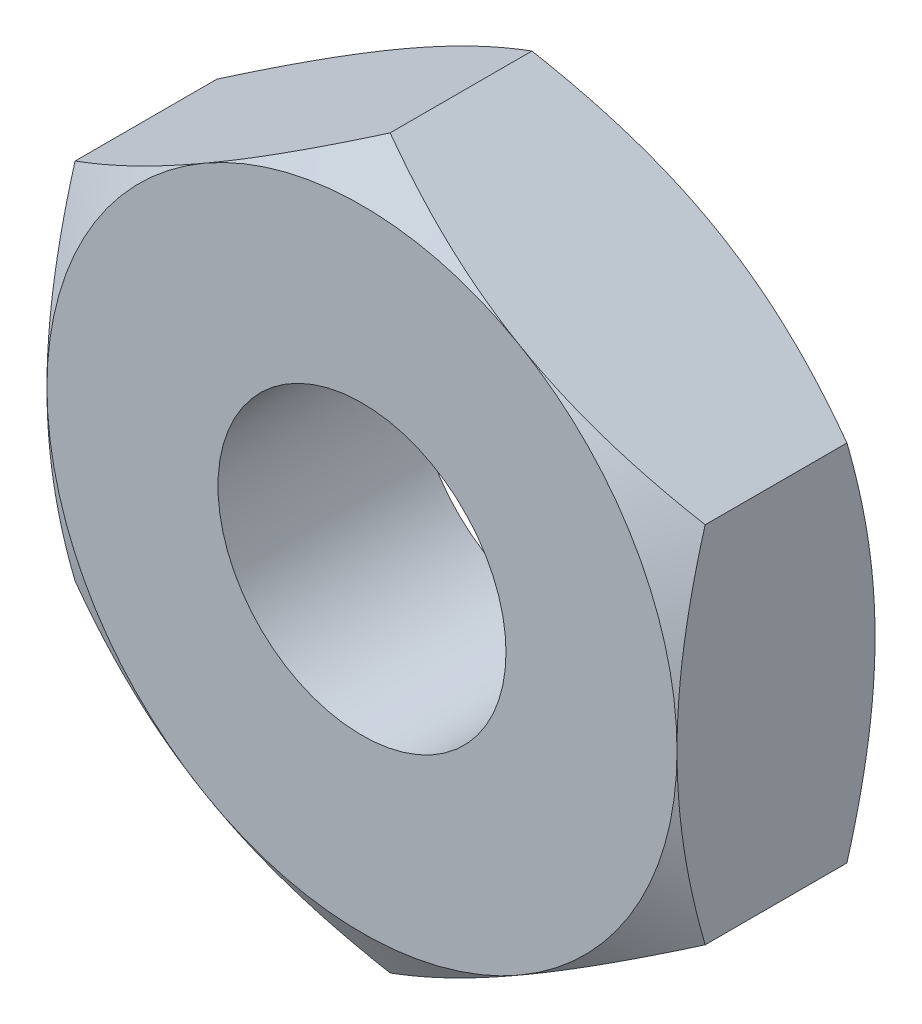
ISO-10303-21;
HEADER;
FILE_DESCRIPTION(('STEP AP214'),'2;1');
FILE_NAME('part.step','',(''),(''),'','','');
FILE_SCHEMA(('AUTOMOTIVE_DESIGN { 1 0 10303 214 1 1 1 1 }'));
ENDSEC;
DATA;
#1=APPLICATION_CONTEXT('core data for automotive mechanical design processes');
#2=APPLICATION_PROTOCOL_DEFINITION('international standard','automotive_design',2000,#1);
#3=PRODUCT_CONTEXT('',#1,'mechanical');
#4=PRODUCT('Part','Part','',(#3));
#5=PRODUCT_RELATED_PRODUCT_CATEGORY('part','',(#4));
#6=PRODUCT_DEFINITION_FORMATION('','',#4);
#7=PRODUCT_DEFINITION_CONTEXT('part definition',#1,'design');
#8=PRODUCT_DEFINITION('design','',#6,#7);
#9=PRODUCT_DEFINITION_SHAPE('','',#8);
#10=(LENGTH_UNIT() NAMED_UNIT(*) SI_UNIT(.MILLI.,.METRE.));
#11=(NAMED_UNIT(*) PLANE_ANGLE_UNIT() SI_UNIT($,.RADIAN.));
#12=(NAMED_UNIT(*) SI_UNIT($,.STERADIAN.) SOLID_ANGLE_UNIT());
#13=UNCERTAINTY_MEASURE_WITH_UNIT(LENGTH_MEASURE(1.E-05),#10,'distance_accuracy_value','');
#14=(GEOMETRIC_REPRESENTATION_CONTEXT(3) GLOBAL_UNCERTAINTY_ASSIGNED_CONTEXT((#13)) GLOBAL_UNIT_ASSIGNED_CONTEXT((#10,
#11,#12)) REPRESENTATION_CONTEXT('',''));
#15=CARTESIAN_POINT('',(0.,0.,0.));
#16=DIRECTION('',(0.,0.,1.));
#17=DIRECTION('',(1.,0.,0.));
#18=AXIS2_PLACEMENT_3D('',#15,#16,#17);
#19=CARTESIAN_POINT('',(-3.5,6.06217782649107,0.));
#20=DIRECTION('',(0.,0.,-1.));
#21=DIRECTION('',(-1.,0.,0.));
#22=AXIS2_PLACEMENT_3D('',#19,#20,#21);
#23=PLANE('',#22);
#24=CARTESIAN_POINT('',(0.,0.,0.));
#25=DIRECTION('',(0.,0.,1.));
#26=DIRECTION('',(1.,0.,0.));
#27=AXIS2_PLACEMENT_3D('',#24,#25,#26);
#28=CIRCLE('',#27,1.6);
#29=CARTESIAN_POINT('',(1.6,0.,0.));
#30=VERTEX_POINT('',#29);
#31=EDGE_CURVE('E316',#30,#30,#28,.T.);
#32=ORIENTED_EDGE('',*,*,#31,.F.);
#33=EDGE_LOOP('',(#32));
#34=FACE_BOUND('',#33,.T.);
#35=CARTESIAN_POINT('',(0.,0.,0.));
#36=DIRECTION('',(0.,0.,-1.));
#37=DIRECTION('',(-1.,0.,0.));
#38=AXIS2_PLACEMENT_3D('',#35,#36,#37);
#39=CIRCLE('',#38,3.5);
#40=CARTESIAN_POINT('',(-3.5,0.,0.));
#41=VERTEX_POINT('',#40);
#42=CARTESIAN_POINT('',(-1.75,3.03108891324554,0.));
#43=VERTEX_POINT('',#42);
#44=EDGE_CURVE('E324',#41,#43,#39,.T.);
#45=ORIENTED_EDGE('',*,*,#44,.F.);
#46=CARTESIAN_POINT('',(0.,0.,0.));
#47=DIRECTION('',(0.,0.,-1.));
#48=DIRECTION('',(-1.,0.,0.));
#49=AXIS2_PLACEMENT_3D('',#46,#47,#48);
#50=CIRCLE('',#49,3.5);
#51=CARTESIAN_POINT('',(-1.75,-3.03108891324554,0.));
#52=VERTEX_POINT('',#51);
#53=EDGE_CURVE('E146',#41,#52,#50,.F.);
#54=ORIENTED_EDGE('',*,*,#53,.T.);
#55=CARTESIAN_POINT('',(1.75,-3.03108891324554,0.));
#56=VERTEX_POINT('',#55);
#57=EDGE_CURVE('E248',#52,#56,#50,.F.);
#58=ORIENTED_EDGE('',*,*,#57,.T.);
#59=CARTESIAN_POINT('',(3.5,0.,0.));
#60=VERTEX_POINT('',#59);
#61=EDGE_CURVE('E149',#56,#60,#50,.F.);
#62=ORIENTED_EDGE('',*,*,#61,.T.);
#63=CARTESIAN_POINT('',(1.75,3.03108891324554,0.));
#64=VERTEX_POINT('',#63);
#65=EDGE_CURVE('E124',#60,#64,#50,.F.);
#66=ORIENTED_EDGE('',*,*,#65,.T.);
#67=EDGE_CURVE('E137',#64,#43,#50,.F.);
#68=ORIENTED_EDGE('',*,*,#67,.T.);
#69=EDGE_LOOP('',(#45,#54,#58,#62,#66,#68));
#70=FACE_BOUND('',#69,.T.);
#71=ADVANCED_FACE('F29',(#34,#70),#23,.F.);
#72=CARTESIAN_POINT('',(0.,0.,0.));
#73=DIRECTION('',(0.,0.,-1.));
#74=DIRECTION('',(-1.,0.,0.));
#75=AXIS2_PLACEMENT_3D('',#72,#73,#74);
#76=CONICAL_SURFACE('',#75,3.5,1.0471975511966);
#77=CARTESIAN_POINT('',(-3.5,-5.46924830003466,-1.72817064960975));
#78=CARTESIAN_POINT('',(-3.5,-5.3160325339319,-1.65368203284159));
#79=CARTESIAN_POINT('',(-3.5,-5.16246946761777,-1.57989576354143));
#80=CARTESIAN_POINT('',(-3.5,-4.85446420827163,-1.43412210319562));
#81=CARTESIAN_POINT('',(-3.5,-4.70002188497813,-1.36213498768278));
#82=CARTESIAN_POINT('',(-3.5,-4.38929746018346,-1.22000042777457));
#83=CARTESIAN_POINT('',(-3.5,-4.23300994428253,-1.14986477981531));
#84=CARTESIAN_POINT('',(-3.5,-3.91920628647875,-1.01240881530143));
#85=CARTESIAN_POINT('',(-3.5,-3.76169020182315,-0.945088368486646));
#86=CARTESIAN_POINT('',(-3.5,-3.43992986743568,-0.811830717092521));
#87=CARTESIAN_POINT('',(-3.5,-3.27563570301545,-0.746013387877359));
#88=CARTESIAN_POINT('',(-3.5,-2.94514050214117,-0.619260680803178));
#89=CARTESIAN_POINT('',(-3.5,-2.7789392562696,-0.558325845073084));
#90=CARTESIAN_POINT('',(-3.5,-2.44466350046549,-0.442907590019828));
#91=CARTESIAN_POINT('',(-3.5,-2.2765934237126,-0.388411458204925));
#92=CARTESIAN_POINT('',(-3.5,-1.93804244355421,-0.287592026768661));
#93=CARTESIAN_POINT('',(-3.5,-1.76756230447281,-0.241266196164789));
#94=CARTESIAN_POINT('',(-3.5,-1.42505372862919,-0.159233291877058));
#95=CARTESIAN_POINT('',(-3.5,-1.25303977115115,-0.123466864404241));
#96=CARTESIAN_POINT('',(-3.5,-0.906829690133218,-0.0645428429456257));
#97=CARTESIAN_POINT('',(-3.5,-0.732633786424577,-0.0413839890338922));
#98=CARTESIAN_POINT('',(-3.5,-0.385221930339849,-0.00982402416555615));
#99=CARTESIAN_POINT('',(-3.5,-0.212023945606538,-0.00123000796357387));
#100=CARTESIAN_POINT('',(-3.5,0.134483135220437,0.000982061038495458));
#101=CARTESIAN_POINT('',(-3.5,0.307792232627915,-0.00540006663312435));
#102=CARTESIAN_POINT('',(-3.5,0.600808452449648,-0.0283953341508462));
#103=CARTESIAN_POINT('',(-3.5,0.720823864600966,-0.0413165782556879));
#104=CARTESIAN_POINT('',(-3.5,0.959997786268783,-0.0735584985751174));
#105=CARTESIAN_POINT('',(-3.5,1.07915618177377,-0.092880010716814));
#106=CARTESIAN_POINT('',(-3.5,1.43517556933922,-0.159431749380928));
#107=CARTESIAN_POINT('',(-3.5,1.67045252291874,-0.215237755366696));
#108=CARTESIAN_POINT('',(-3.5,2.02230281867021,-0.312280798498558));
#109=CARTESIAN_POINT('',(-3.5,2.14069288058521,-0.34730856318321));
#110=CARTESIAN_POINT('',(-3.5,2.37632363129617,-0.421071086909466));
#111=CARTESIAN_POINT('',(-3.5,2.493564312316,-0.459805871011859));
#112=CARTESIAN_POINT('',(-3.5,2.72693202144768,-0.540355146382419));
#113=CARTESIAN_POINT('',(-3.5,2.84305938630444,-0.582168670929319));
#114=CARTESIAN_POINT('',(-3.5,3.07434746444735,-0.668376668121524));
#115=CARTESIAN_POINT('',(-3.5,3.18950819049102,-0.712771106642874));
#116=CARTESIAN_POINT('',(-3.5,3.46665383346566,-0.822612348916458));
#117=CARTESIAN_POINT('',(-3.5,3.62820926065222,-0.889140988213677));
#118=CARTESIAN_POINT('',(-3.5,3.94989428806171,-1.0255706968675));
#119=CARTESIAN_POINT('',(-3.5,4.11002378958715,-1.09547199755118));
#120=CARTESIAN_POINT('',(-3.5,4.42912766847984,-1.23795147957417));
#121=CARTESIAN_POINT('',(-3.5,4.58810177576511,-1.31053026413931));
#122=CARTESIAN_POINT('',(-3.5,4.9050615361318,-1.45781837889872));
#123=CARTESIAN_POINT('',(-3.5,5.06304716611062,-1.5325277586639));
#124=CARTESIAN_POINT('',(-3.5,5.53614087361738,-1.75938858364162));
#125=CARTESIAN_POINT('',(-3.5,5.85001764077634,-1.91410589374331));
#126=CARTESIAN_POINT('',(-3.5,6.47541755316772,-2.22809162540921));
#127=CARTESIAN_POINT('',(-3.5,6.78694100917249,-2.38735943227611));
#128=CARTESIAN_POINT('',(-3.5,7.38120615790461,-2.6950811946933));
#129=CARTESIAN_POINT('',(-3.5,7.66408741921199,-2.84326612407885));
#130=CARTESIAN_POINT('',(-3.5,8.22880069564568,-3.14164545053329));
#131=CARTESIAN_POINT('',(-3.5,8.5106326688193,-3.29183992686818));
#132=CARTESIAN_POINT('',(-3.5,9.07272628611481,-3.59335012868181));
#133=CARTESIAN_POINT('',(-3.5,9.35299011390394,-3.74466178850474));
#134=CARTESIAN_POINT('',(-3.5,9.91284986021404,-4.04847672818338));
#135=CARTESIAN_POINT('',(-3.5,10.1924458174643,-4.20097993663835));
#136=CARTESIAN_POINT('',(-3.5,10.4717977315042,-4.35392562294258));
#137=B_SPLINE_CURVE_WITH_KNOTS('',3,(#77,#78,#79,#80,#81,#82,#83,#84,#85,#86,#87,#88,#89,#90,
#91,#92,#93,#94,#95,#96,#97,#98,#99,#100,#101,#102,#103,#104,#105,#106,#107,#108,#109,#110,#111,
#112,#113,#114,#115,#116,#117,#118,#119,#120,#121,#122,#123,#124,#125,#126,#127,#128,#129,#130,
#131,#132,#133,#134,#135,#136),.UNSPECIFIED.,.F.,.F.,(4,2,2,2,2,2,2,2,2,2,2,2,2,2,2,2,2,2,2,2,2,
2,2,2,2,2,2,2,2,4),(0.,0.511095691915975,1.02226918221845,1.53615661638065,2.05002024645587,
2.58092205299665,3.11188272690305,3.64177691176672,4.17150665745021,4.69819951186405,
5.22483972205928,5.74444865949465,6.26406385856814,6.62601594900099,6.98801533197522,
7.71239857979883,8.08275565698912,8.45311523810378,8.82335901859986,9.193597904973,
9.71769804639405,10.2418341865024,10.7660891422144,11.2903563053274,12.3401028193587,
13.3897081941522,14.3477294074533,15.3057885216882,16.2612890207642,17.216732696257),.UNSPECIFIED.);
#138=CARTESIAN_POINT('',(-3.5,2.0207259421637,-0.312607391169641));
#139=VERTEX_POINT('',#138);
#140=EDGE_CURVE('E154',#139,#41,#137,.F.);
#141=ORIENTED_EDGE('',*,*,#140,.T.);
#142=ORIENTED_EDGE('',*,*,#44,.T.);
#143=CARTESIAN_POINT('',(0.0002,4.04156735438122,-0.312674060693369));
#144=CARTESIAN_POINT('',(-0.153607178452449,3.9527667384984,-0.261385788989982));
#145=CARTESIAN_POINT('',(-0.308742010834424,3.86319960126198,-0.214740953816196));
#146=CARTESIAN_POINT('',(-0.621698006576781,3.68251437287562,-0.133321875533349));
#147=CARTESIAN_POINT('',(-0.779524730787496,3.59139307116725,-0.0985764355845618));
#148=CARTESIAN_POINT('',(-1.09322221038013,3.41027974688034,-0.0444900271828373));
#149=CARTESIAN_POINT('',(-1.24904469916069,3.32031559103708,-0.0247890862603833));
#150=CARTESIAN_POINT('',(-1.56142288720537,3.13996396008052,-0.00127013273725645));
#151=CARTESIAN_POINT('',(-1.71797745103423,3.04957714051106,0.00256735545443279));
#152=CARTESIAN_POINT('',(-2.01050921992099,2.88068384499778,-0.00541530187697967));
#153=CARTESIAN_POINT('',(-2.14653021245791,2.80215208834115,-0.0152754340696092));
#154=CARTESIAN_POINT('',(-2.41768602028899,2.64560020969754,-0.0465264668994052));
#155=CARTESIAN_POINT('',(-2.55281989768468,2.5675806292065,-0.0679280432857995));
#156=CARTESIAN_POINT('',(-2.82453479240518,2.41070596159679,-0.121430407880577));
#157=CARTESIAN_POINT('',(-2.96108141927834,2.33187072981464,-0.153757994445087));
#158=CARTESIAN_POINT('',(-3.2321380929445,2.17537608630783,-0.227128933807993));
#159=CARTESIAN_POINT('',(-3.36665161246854,2.09771466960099,-0.268155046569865));
#160=CARTESIAN_POINT('',(-3.5002,2.02061047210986,-0.312674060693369));
#161=B_SPLINE_CURVE_WITH_KNOTS('',3,(#143,#144,#145,#146,#147,#148,#149,#150,#151,#152,#153,
#154,#155,#156,#157,#158,#159,#160),.UNSPECIFIED.,.F.,.F.,(4,2,2,2,2,2,2,2,4),(0.,
0.554793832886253,1.11092123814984,1.65328467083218,2.19498204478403,2.6666513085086,
3.13875761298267,3.62133612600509,4.10296698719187),.UNSPECIFIED.);
#162=EDGE_CURVE('E186',#43,#139,#161,.T.);
#163=ORIENTED_EDGE('',*,*,#162,.T.);
#164=EDGE_LOOP('',(#141,#142,#163));
#165=FACE_BOUND('',#164,.T.);
#166=ADVANCED_FACE('F173',(#165),#76,.T.);
#167=CARTESIAN_POINT('',(3.5002,2.02061047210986,-0.312674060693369));
#168=CARTESIAN_POINT('',(3.34639282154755,2.10941108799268,-0.261385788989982));
#169=CARTESIAN_POINT('',(3.19125798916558,2.1989782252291,-0.214740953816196));
#170=CARTESIAN_POINT('',(2.87830199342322,2.37966345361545,-0.133321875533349));
#171=CARTESIAN_POINT('',(2.7204752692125,2.47078475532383,-0.0985764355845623));
#172=CARTESIAN_POINT('',(2.40677778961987,2.65189807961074,-0.0444900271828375));
#173=CARTESIAN_POINT('',(2.25095530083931,2.741862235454,-0.0247890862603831));
#174=CARTESIAN_POINT('',(1.93857711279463,2.92221386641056,-0.0012701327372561));
#175=CARTESIAN_POINT('',(1.78202254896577,3.01260068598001,0.00256735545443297));
#176=CARTESIAN_POINT('',(1.48949078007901,3.1814939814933,-0.00541530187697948));
#177=CARTESIAN_POINT('',(1.35346978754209,3.26002573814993,-0.0152754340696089));
#178=CARTESIAN_POINT('',(1.08231397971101,3.41657761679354,-0.0465264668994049));
#179=CARTESIAN_POINT('',(0.947180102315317,3.49459719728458,-0.0679280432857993));
#180=CARTESIAN_POINT('',(0.675465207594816,3.65147186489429,-0.121430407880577));
#181=CARTESIAN_POINT('',(0.538918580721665,3.73030709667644,-0.153757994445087));
#182=CARTESIAN_POINT('',(0.267861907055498,3.88680174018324,-0.227128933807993));
#183=CARTESIAN_POINT('',(0.133348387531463,3.96446315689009,-0.268155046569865));
#184=CARTESIAN_POINT('',(-0.000199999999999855,4.04156735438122,-0.312674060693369));
#185=B_SPLINE_CURVE_WITH_KNOTS('',3,(#167,#168,#169,#170,#171,#172,#173,#174,#175,#176,#177,
#178,#179,#180,#181,#182,#183,#184),.UNSPECIFIED.,.F.,.F.,(4,2,2,2,2,2,2,2,4),(0.,
0.554793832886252,1.11092123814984,1.65328467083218,2.19498204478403,2.6666513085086,
3.13875761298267,3.62133612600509,4.10296698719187),.UNSPECIFIED.);
#186=CARTESIAN_POINT('',(0.,4.04145188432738,-0.312607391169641));
#187=VERTEX_POINT('',#186);
#188=EDGE_CURVE('E133',#64,#187,#185,.T.);
#189=ORIENTED_EDGE('',*,*,#188,.T.);
#190=EDGE_CURVE('E140',#187,#43,#161,.T.);
#191=ORIENTED_EDGE('',*,*,#190,.T.);
#192=ORIENTED_EDGE('',*,*,#67,.F.);
#193=EDGE_LOOP('',(#189,#191,#192));
#194=FACE_BOUND('',#193,.T.);
#195=ADVANCED_FACE('F138',(#194),#76,.T.);
#196=CARTESIAN_POINT('',(3.5,-5.46924830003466,-1.72817064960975));
#197=CARTESIAN_POINT('',(3.5,-5.3160325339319,-1.65368203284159));
#198=CARTESIAN_POINT('',(3.5,-5.16246946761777,-1.57989576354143));
#199=CARTESIAN_POINT('',(3.5,-4.85446420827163,-1.43412210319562));
#200=CARTESIAN_POINT('',(3.5,-4.70002188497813,-1.36213498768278));
#201=CARTESIAN_POINT('',(3.5,-4.38929746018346,-1.22000042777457));
#202=CARTESIAN_POINT('',(3.5,-4.23300994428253,-1.14986477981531));
#203=CARTESIAN_POINT('',(3.5,-3.91920628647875,-1.01240881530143));
#204=CARTESIAN_POINT('',(3.5,-3.76169020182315,-0.945088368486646));
#205=CARTESIAN_POINT('',(3.5,-3.43992986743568,-0.811830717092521));
#206=CARTESIAN_POINT('',(3.5,-3.27563570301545,-0.746013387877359));
#207=CARTESIAN_POINT('',(3.5,-2.94514050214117,-0.619260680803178));
#208=CARTESIAN_POINT('',(3.5,-2.7789392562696,-0.558325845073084));
#209=CARTESIAN_POINT('',(3.5,-2.44466350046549,-0.442907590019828));
#210=CARTESIAN_POINT('',(3.5,-2.2765934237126,-0.388411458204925));
#211=CARTESIAN_POINT('',(3.5,-1.93804244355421,-0.287592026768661));
#212=CARTESIAN_POINT('',(3.5,-1.76756230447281,-0.241266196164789));
#213=CARTESIAN_POINT('',(3.5,-1.42505372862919,-0.159233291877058));
#214=CARTESIAN_POINT('',(3.5,-1.25303977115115,-0.123466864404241));
#215=CARTESIAN_POINT('',(3.5,-0.906829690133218,-0.0645428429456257));
#216=CARTESIAN_POINT('',(3.5,-0.732633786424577,-0.0413839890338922));
#217=CARTESIAN_POINT('',(3.5,-0.385221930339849,-0.00982402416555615));
#218=CARTESIAN_POINT('',(3.5,-0.212023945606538,-0.00123000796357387));
#219=CARTESIAN_POINT('',(3.5,0.134483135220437,0.000982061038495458));
#220=CARTESIAN_POINT('',(3.5,0.307792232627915,-0.00540006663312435));
#221=CARTESIAN_POINT('',(3.5,0.600808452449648,-0.0283953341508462));
#222=CARTESIAN_POINT('',(3.5,0.720823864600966,-0.0413165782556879));
#223=CARTESIAN_POINT('',(3.5,0.959997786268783,-0.0735584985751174));
#224=CARTESIAN_POINT('',(3.5,1.07915618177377,-0.092880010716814));
#225=CARTESIAN_POINT('',(3.5,1.43517556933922,-0.159431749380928));
#226=CARTESIAN_POINT('',(3.5,1.67045252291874,-0.215237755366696));
#227=CARTESIAN_POINT('',(3.5,2.02230281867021,-0.312280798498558));
#228=CARTESIAN_POINT('',(3.5,2.14069288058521,-0.34730856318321));
#229=CARTESIAN_POINT('',(3.5,2.37632363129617,-0.421071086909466));
#230=CARTESIAN_POINT('',(3.5,2.493564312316,-0.459805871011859));
#231=CARTESIAN_POINT('',(3.5,2.72693202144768,-0.540355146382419));
#232=CARTESIAN_POINT('',(3.5,2.84305938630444,-0.582168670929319));
#233=CARTESIAN_POINT('',(3.5,3.07434746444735,-0.668376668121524));
#234=CARTESIAN_POINT('',(3.5,3.18950819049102,-0.712771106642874));
#235=CARTESIAN_POINT('',(3.5,3.46665383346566,-0.822612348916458));
#236=CARTESIAN_POINT('',(3.5,3.62820926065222,-0.889140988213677));
#237=CARTESIAN_POINT('',(3.5,3.94989428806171,-1.0255706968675));
#238=CARTESIAN_POINT('',(3.5,4.11002378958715,-1.09547199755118));
#239=CARTESIAN_POINT('',(3.5,4.42912766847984,-1.23795147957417));
#240=CARTESIAN_POINT('',(3.5,4.58810177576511,-1.31053026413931));
#241=CARTESIAN_POINT('',(3.5,4.9050615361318,-1.45781837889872));
#242=CARTESIAN_POINT('',(3.5,5.06304716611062,-1.5325277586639));
#243=CARTESIAN_POINT('',(3.5,5.53614087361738,-1.75938858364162));
#244=CARTESIAN_POINT('',(3.5,5.85001764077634,-1.91410589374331));
#245=CARTESIAN_POINT('',(3.5,6.47541755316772,-2.22809162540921));
#246=CARTESIAN_POINT('',(3.5,6.78694100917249,-2.38735943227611));
#247=CARTESIAN_POINT('',(3.5,7.38120615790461,-2.6950811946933));
#248=CARTESIAN_POINT('',(3.5,7.66408741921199,-2.84326612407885));
#249=CARTESIAN_POINT('',(3.5,8.22880069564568,-3.14164545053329));
#250=CARTESIAN_POINT('',(3.5,8.5106326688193,-3.29183992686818));
#251=CARTESIAN_POINT('',(3.5,9.07272628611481,-3.59335012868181));
#252=CARTESIAN_POINT('',(3.5,9.35299011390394,-3.74466178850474));
#253=CARTESIAN_POINT('',(3.5,9.91284986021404,-4.04847672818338));
#254=CARTESIAN_POINT('',(3.5,10.1924458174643,-4.20097993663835));
#255=CARTESIAN_POINT('',(3.5,10.4717977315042,-4.35392562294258));
#256=B_SPLINE_CURVE_WITH_KNOTS('',3,(#196,#197,#198,#199,#200,#201,#202,#203,#204,#205,#206,
#207,#208,#209,#210,#211,#212,#213,#214,#215,#216,#217,#218,#219,#220,#221,#222,#223,#224,#225,
#226,#227,#228,#229,#230,#231,#232,#233,#234,#235,#236,#237,#238,#239,#240,#241,#242,#243,#244,
#245,#246,#247,#248,#249,#250,#251,#252,#253,#254,#255),.UNSPECIFIED.,.F.,.F.,(4,2,2,2,2,2,2,2,
2,2,2,2,2,2,2,2,2,2,2,2,2,2,2,2,2,2,2,2,2,4),(0.,0.511095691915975,1.02226918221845,
1.53615661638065,2.05002024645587,2.58092205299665,3.11188272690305,3.64177691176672,
4.17150665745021,4.69819951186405,5.22483972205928,5.74444865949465,6.26406385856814,
6.62601594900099,6.98801533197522,7.71239857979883,8.08275565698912,8.45311523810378,
8.82335901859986,9.193597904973,9.71769804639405,10.2418341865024,10.7660891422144,
11.2903563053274,12.3401028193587,13.3897081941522,14.3477294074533,15.3057885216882,
16.2612890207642,17.216732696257),.UNSPECIFIED.);
#257=CARTESIAN_POINT('',(3.5,2.0207259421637,-0.312607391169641));
#258=VERTEX_POINT('',#257);
#259=EDGE_CURVE('E127',#60,#258,#256,.T.);
#260=ORIENTED_EDGE('',*,*,#259,.T.);
#261=EDGE_CURVE('E120',#258,#64,#185,.T.);
#262=ORIENTED_EDGE('',*,*,#261,.T.);
#263=ORIENTED_EDGE('',*,*,#65,.F.);
#264=EDGE_LOOP('',(#260,#262,#263));
#265=FACE_BOUND('',#264,.T.);
#266=ADVANCED_FACE('F122',(#265),#76,.T.);
#267=CARTESIAN_POINT('',(-0.0002,-4.04156735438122,-0.312674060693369));
#268=CARTESIAN_POINT('',(0.153607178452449,-3.9527667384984,-0.261385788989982));
#269=CARTESIAN_POINT('',(0.308742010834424,-3.86319960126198,-0.214740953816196));
#270=CARTESIAN_POINT('',(0.621698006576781,-3.68251437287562,-0.133321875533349));
#271=CARTESIAN_POINT('',(0.779524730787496,-3.59139307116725,-0.0985764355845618));
#272=CARTESIAN_POINT('',(1.09322221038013,-3.41027974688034,-0.0444900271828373));
#273=CARTESIAN_POINT('',(1.24904469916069,-3.32031559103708,-0.0247890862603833));
#274=CARTESIAN_POINT('',(1.56142288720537,-3.13996396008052,-0.00127013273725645));
#275=CARTESIAN_POINT('',(1.71797745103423,-3.04957714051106,0.00256735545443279));
#276=CARTESIAN_POINT('',(2.01050921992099,-2.88068384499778,-0.00541530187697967));
#277=CARTESIAN_POINT('',(2.14653021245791,-2.80215208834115,-0.0152754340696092));
#278=CARTESIAN_POINT('',(2.41768602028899,-2.64560020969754,-0.0465264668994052));
#279=CARTESIAN_POINT('',(2.55281989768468,-2.5675806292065,-0.0679280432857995));
#280=CARTESIAN_POINT('',(2.82453479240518,-2.41070596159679,-0.121430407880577));
#281=CARTESIAN_POINT('',(2.96108141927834,-2.33187072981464,-0.153757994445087));
#282=CARTESIAN_POINT('',(3.2321380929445,-2.17537608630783,-0.227128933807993));
#283=CARTESIAN_POINT('',(3.36665161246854,-2.09771466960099,-0.268155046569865));
#284=CARTESIAN_POINT('',(3.5002,-2.02061047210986,-0.312674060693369));
#285=B_SPLINE_CURVE_WITH_KNOTS('',3,(#267,#268,#269,#270,#271,#272,#273,#274,#275,#276,#277,
#278,#279,#280,#281,#282,#283,#284),.UNSPECIFIED.,.F.,.F.,(4,2,2,2,2,2,2,2,4),(0.,
0.554793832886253,1.11092123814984,1.65328467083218,2.19498204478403,2.6666513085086,
3.13875761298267,3.62133612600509,4.10296698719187),.UNSPECIFIED.);
#286=CARTESIAN_POINT('',(3.5,-2.020725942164,-0.312607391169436));
#287=VERTEX_POINT('',#286);
#288=EDGE_CURVE('E200',#56,#287,#285,.T.);
#289=ORIENTED_EDGE('',*,*,#288,.T.);
#290=EDGE_CURVE('E199',#287,#60,#256,.T.);
#291=ORIENTED_EDGE('',*,*,#290,.T.);
#292=ORIENTED_EDGE('',*,*,#61,.F.);
#293=EDGE_LOOP('',(#289,#291,#292));
#294=FACE_BOUND('',#293,.T.);
#295=ADVANCED_FACE('F424',(#294),#76,.T.);
#296=CARTESIAN_POINT('',(0.,-4.04145188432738,-0.312607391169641));
#297=VERTEX_POINT('',#296);
#298=EDGE_CURVE('E258',#297,#56,#285,.T.);
#299=ORIENTED_EDGE('',*,*,#298,.T.);
#300=ORIENTED_EDGE('',*,*,#57,.F.);
#301=CARTESIAN_POINT('',(-3.5002,-2.02061047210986,-0.312674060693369));
#302=CARTESIAN_POINT('',(-3.34639282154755,-2.10941108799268,-0.261385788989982));
#303=CARTESIAN_POINT('',(-3.19125798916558,-2.1989782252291,-0.214740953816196));
#304=CARTESIAN_POINT('',(-2.87830199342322,-2.37966345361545,-0.133321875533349));
#305=CARTESIAN_POINT('',(-2.7204752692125,-2.47078475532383,-0.0985764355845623));
#306=CARTESIAN_POINT('',(-2.40677778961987,-2.65189807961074,-0.0444900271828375));
#307=CARTESIAN_POINT('',(-2.25095530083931,-2.741862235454,-0.0247890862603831));
#308=CARTESIAN_POINT('',(-1.93857711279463,-2.92221386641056,-0.0012701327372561));
#309=CARTESIAN_POINT('',(-1.78202254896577,-3.01260068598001,0.00256735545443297));
#310=CARTESIAN_POINT('',(-1.48949078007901,-3.1814939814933,-0.00541530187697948));
#311=CARTESIAN_POINT('',(-1.35346978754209,-3.26002573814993,-0.0152754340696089));
#312=CARTESIAN_POINT('',(-1.08231397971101,-3.41657761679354,-0.0465264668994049));
#313=CARTESIAN_POINT('',(-0.947180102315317,-3.49459719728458,-0.0679280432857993));
#314=CARTESIAN_POINT('',(-0.675465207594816,-3.65147186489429,-0.121430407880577));
#315=CARTESIAN_POINT('',(-0.538918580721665,-3.73030709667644,-0.153757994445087));
#316=CARTESIAN_POINT('',(-0.267861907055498,-3.88680174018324,-0.227128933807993));
#317=CARTESIAN_POINT('',(-0.133348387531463,-3.96446315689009,-0.268155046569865));
#318=CARTESIAN_POINT('',(0.000199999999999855,-4.04156735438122,-0.312674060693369));
#319=B_SPLINE_CURVE_WITH_KNOTS('',3,(#301,#302,#303,#304,#305,#306,#307,#308,#309,#310,#311,
#312,#313,#314,#315,#316,#317,#318),.UNSPECIFIED.,.F.,.F.,(4,2,2,2,2,2,2,2,4),(0.,
0.554793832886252,1.11092123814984,1.65328467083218,2.19498204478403,2.6666513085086,
3.13875761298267,3.62133612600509,4.10296698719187),.UNSPECIFIED.);
#320=EDGE_CURVE('E262',#52,#297,#319,.T.);
#321=ORIENTED_EDGE('',*,*,#320,.T.);
#322=EDGE_LOOP('',(#299,#300,#321));
#323=FACE_BOUND('',#322,.T.);
#324=ADVANCED_FACE('F179',(#323),#76,.T.);
#325=CARTESIAN_POINT('',(-3.5,-2.020725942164,-0.312607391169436));
#326=VERTEX_POINT('',#325);
#327=EDGE_CURVE('E167',#326,#52,#319,.T.);
#328=ORIENTED_EDGE('',*,*,#327,.T.);
#329=ORIENTED_EDGE('',*,*,#53,.F.);
#330=EDGE_CURVE('E132',#41,#326,#137,.F.);
#331=ORIENTED_EDGE('',*,*,#330,.T.);
#332=EDGE_LOOP('',(#328,#329,#331));
#333=FACE_BOUND('',#332,.T.);
#334=ADVANCED_FACE('F267',(#333),#76,.T.);
#335=CARTESIAN_POINT('',(3.5,2.0207259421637,-2.2));
#336=DIRECTION('',(0.499999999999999,0.866025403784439,0.));
#337=DIRECTION('',(-0.866025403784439,0.499999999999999,0.));
#338=AXIS2_PLACEMENT_3D('',#335,#336,#337);
#339=PLANE('',#338);
#340=CARTESIAN_POINT('',(-0.0002,4.04156735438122,-1.88732593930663));
#341=CARTESIAN_POINT('',(0.153607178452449,3.9527667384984,-1.93861421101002));
#342=CARTESIAN_POINT('',(0.308742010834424,3.86319960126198,-1.9852590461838));
#343=CARTESIAN_POINT('',(0.621698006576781,3.68251437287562,-2.06667812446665));
#344=CARTESIAN_POINT('',(0.779524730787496,3.59139307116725,-2.10142356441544));
#345=CARTESIAN_POINT('',(1.09322221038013,3.41027974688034,-2.15550997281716));
#346=CARTESIAN_POINT('',(1.24904469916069,3.32031559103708,-2.17521091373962));
#347=CARTESIAN_POINT('',(1.56142288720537,3.13996396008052,-2.19872986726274));
#348=CARTESIAN_POINT('',(1.71797745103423,3.04957714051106,-2.20256735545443));
#349=CARTESIAN_POINT('',(2.01050921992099,2.88068384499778,-2.19458469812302));
#350=CARTESIAN_POINT('',(2.14653021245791,2.80215208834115,-2.18472456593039));
#351=CARTESIAN_POINT('',(2.41768602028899,2.64560020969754,-2.15347353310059));
#352=CARTESIAN_POINT('',(2.55281989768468,2.5675806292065,-2.1320719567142));
#353=CARTESIAN_POINT('',(2.82453479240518,2.41070596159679,-2.07856959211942));
#354=CARTESIAN_POINT('',(2.96108141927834,2.33187072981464,-2.04624200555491));
#355=CARTESIAN_POINT('',(3.2321380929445,2.17537608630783,-1.97287106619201));
#356=CARTESIAN_POINT('',(3.36665161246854,2.09771466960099,-1.93184495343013));
#357=CARTESIAN_POINT('',(3.5002,2.02061047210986,-1.88732593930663));
#358=B_SPLINE_CURVE_WITH_KNOTS('',3,(#340,#341,#342,#343,#344,#345,#346,#347,#348,#349,#350,
#351,#352,#353,#354,#355,#356,#357),.UNSPECIFIED.,.F.,.F.,(4,2,2,2,2,2,2,2,4),(0.,
0.554793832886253,1.11092123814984,1.65328467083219,2.19498204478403,2.6666513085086,
3.13875761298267,3.62133612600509,4.10296698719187),.UNSPECIFIED.);
#359=CARTESIAN_POINT('',(0.,4.04145188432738,-1.88739260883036));
#360=VERTEX_POINT('',#359);
#361=CARTESIAN_POINT('',(1.75,3.03108891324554,-2.2));
#362=VERTEX_POINT('',#361);
#363=EDGE_CURVE('E233',#360,#362,#358,.T.);
#364=ORIENTED_EDGE('',*,*,#363,.F.);
#365=DIRECTION('',(0.,0.,1.));
#366=VECTOR('',#365,1.);
#367=CARTESIAN_POINT('',(0.,4.04145188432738,-2.2));
#368=LINE('',#367,#366);
#369=EDGE_CURVE('E153',#360,#187,#368,.T.);
#370=ORIENTED_EDGE('',*,*,#369,.T.);
#371=ORIENTED_EDGE('',*,*,#188,.F.);
#372=ORIENTED_EDGE('',*,*,#261,.F.);
#373=DIRECTION('',(0.,0.,1.));
#374=VECTOR('',#373,1.);
#375=CARTESIAN_POINT('',(3.5,2.0207259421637,-2.2));
#376=LINE('',#375,#374);
#377=CARTESIAN_POINT('',(3.5,2.0207259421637,-1.88739260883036));
#378=VERTEX_POINT('',#377);
#379=EDGE_CURVE('E145',#378,#258,#376,.T.);
#380=ORIENTED_EDGE('',*,*,#379,.F.);
#381=EDGE_CURVE('E228',#362,#378,#358,.T.);
#382=ORIENTED_EDGE('',*,*,#381,.F.);
#383=EDGE_LOOP('',(#364,#370,#371,#372,#380,#382));
#384=FACE_BOUND('',#383,.T.);
#385=ADVANCED_FACE('F31',(#384),#339,.T.);
#386=CARTESIAN_POINT('',(3.5,-2.0207259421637,-2.2));
#387=DIRECTION('',(1.,0.,0.));
#388=DIRECTION('',(0.,0.,-1.));
#389=AXIS2_PLACEMENT_3D('',#386,#387,#388);
#390=PLANE('',#389);
#391=CARTESIAN_POINT('',(3.5,-5.46924830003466,-0.471829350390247));
#392=CARTESIAN_POINT('',(3.5,-5.3160325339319,-0.546317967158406));
#393=CARTESIAN_POINT('',(3.5,-5.16246946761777,-0.620104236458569));
#394=CARTESIAN_POINT('',(3.5,-4.85446420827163,-0.76587789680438));
#395=CARTESIAN_POINT('',(3.5,-4.70002188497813,-0.837865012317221));
#396=CARTESIAN_POINT('',(3.5,-4.38929746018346,-0.979999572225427));
#397=CARTESIAN_POINT('',(3.5,-4.23300994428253,-1.05013522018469));
#398=CARTESIAN_POINT('',(3.5,-3.91920628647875,-1.18759118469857));
#399=CARTESIAN_POINT('',(3.5,-3.76169020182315,-1.25491163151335));
#400=CARTESIAN_POINT('',(3.5,-3.43992986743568,-1.38816928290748));
#401=CARTESIAN_POINT('',(3.5,-3.27563570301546,-1.45398661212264));
#402=CARTESIAN_POINT('',(3.5,-2.94514050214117,-1.58073931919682));
#403=CARTESIAN_POINT('',(3.5,-2.7789392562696,-1.64167415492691));
#404=CARTESIAN_POINT('',(3.5,-2.44466350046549,-1.75709240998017));
#405=CARTESIAN_POINT('',(3.5,-2.2765934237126,-1.81158854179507));
#406=CARTESIAN_POINT('',(3.5,-1.93804244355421,-1.91240797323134));
#407=CARTESIAN_POINT('',(3.5,-1.76756230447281,-1.95873380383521));
#408=CARTESIAN_POINT('',(3.5,-1.42505372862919,-2.04076670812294));
#409=CARTESIAN_POINT('',(3.5,-1.25303977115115,-2.07653313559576));
#410=CARTESIAN_POINT('',(3.5,-0.906829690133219,-2.13545715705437));
#411=CARTESIAN_POINT('',(3.5,-0.732633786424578,-2.15861601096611));
#412=CARTESIAN_POINT('',(3.5,-0.38522193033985,-2.19017597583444));
#413=CARTESIAN_POINT('',(3.5,-0.212023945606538,-2.19876999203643));
#414=CARTESIAN_POINT('',(3.5,0.134483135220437,-2.2009820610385));
#415=CARTESIAN_POINT('',(3.5,0.307792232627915,-2.19459993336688));
#416=CARTESIAN_POINT('',(3.5,0.600808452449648,-2.17160466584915));
#417=CARTESIAN_POINT('',(3.5,0.720823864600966,-2.15868342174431));
#418=CARTESIAN_POINT('',(3.5,0.959997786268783,-2.12644150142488));
#419=CARTESIAN_POINT('',(3.5,1.07915618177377,-2.10711998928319));
#420=CARTESIAN_POINT('',(3.5,1.43517556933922,-2.04056825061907));
#421=CARTESIAN_POINT('',(3.5,1.67045252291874,-1.9847622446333));
#422=CARTESIAN_POINT('',(3.5,2.02230281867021,-1.88771920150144));
#423=CARTESIAN_POINT('',(3.5,2.1406928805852,-1.85269143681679));
#424=CARTESIAN_POINT('',(3.5,2.37632363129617,-1.77892891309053));
#425=CARTESIAN_POINT('',(3.5,2.493564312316,-1.74019412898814));
#426=CARTESIAN_POINT('',(3.5,2.72693202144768,-1.65964485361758));
#427=CARTESIAN_POINT('',(3.5,2.84305938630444,-1.61783132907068));
#428=CARTESIAN_POINT('',(3.5,3.07434746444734,-1.53162333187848));
#429=CARTESIAN_POINT('',(3.5,3.18950819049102,-1.48722889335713));
#430=CARTESIAN_POINT('',(3.5,3.46665383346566,-1.37738765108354));
#431=CARTESIAN_POINT('',(3.5,3.62820926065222,-1.31085901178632));
#432=CARTESIAN_POINT('',(3.5,3.94989428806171,-1.1744293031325));
#433=CARTESIAN_POINT('',(3.5,4.11002378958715,-1.10452800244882));
#434=CARTESIAN_POINT('',(3.5,4.42912766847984,-0.962048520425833));
#435=CARTESIAN_POINT('',(3.5,4.58810177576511,-0.889469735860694));
#436=CARTESIAN_POINT('',(3.5,4.90506153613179,-0.742181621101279));
#437=CARTESIAN_POINT('',(3.5,5.06304716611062,-0.667472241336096));
#438=CARTESIAN_POINT('',(3.5,5.53614087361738,-0.440611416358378));
#439=CARTESIAN_POINT('',(3.5,5.85001764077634,-0.285894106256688));
#440=CARTESIAN_POINT('',(3.5,6.47541755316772,0.0280916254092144));
#441=CARTESIAN_POINT('',(3.5,6.78694100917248,0.187359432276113));
#442=CARTESIAN_POINT('',(3.5,7.38120615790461,0.495081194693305));
#443=CARTESIAN_POINT('',(3.5,7.66408741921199,0.643266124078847));
#444=CARTESIAN_POINT('',(3.5,8.22880069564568,0.941645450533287));
#445=CARTESIAN_POINT('',(3.5,8.5106326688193,1.09183992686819));
#446=CARTESIAN_POINT('',(3.5,9.07272628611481,1.39335012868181));
#447=CARTESIAN_POINT('',(3.5,9.35299011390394,1.54466178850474));
#448=CARTESIAN_POINT('',(3.5,9.91284986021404,1.84847672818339));
#449=CARTESIAN_POINT('',(3.5,10.1924458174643,2.00097993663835));
#450=CARTESIAN_POINT('',(3.5,10.4717977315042,2.15392562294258));
#451=B_SPLINE_CURVE_WITH_KNOTS('',3,(#391,#392,#393,#394,#395,#396,#397,#398,#399,#400,#401,
#402,#403,#404,#405,#406,#407,#408,#409,#410,#411,#412,#413,#414,#415,#416,#417,#418,#419,#420,
#421,#422,#423,#424,#425,#426,#427,#428,#429,#430,#431,#432,#433,#434,#435,#436,#437,#438,#439,
#440,#441,#442,#443,#444,#445,#446,#447,#448,#449,#450),.UNSPECIFIED.,.F.,.F.,(4,2,2,2,2,2,2,2,
2,2,2,2,2,2,2,2,2,2,2,2,2,2,2,2,2,2,2,2,2,4),(0.,0.511095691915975,1.02226918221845,
1.53615661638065,2.05002024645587,2.58092205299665,3.11188272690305,3.64177691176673,
4.17150665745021,4.69819951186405,5.22483972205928,5.74444865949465,6.26406385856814,
6.626015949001,6.98801533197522,7.71239857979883,8.08275565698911,8.45311523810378,
8.82335901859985,9.19359790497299,9.71769804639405,10.2418341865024,10.7660891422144,
11.2903563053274,12.3401028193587,13.3897081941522,14.3477294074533,15.3057885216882,
16.2612890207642,17.216732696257),.UNSPECIFIED.);
#452=CARTESIAN_POINT('',(3.5,0.,-2.2));
#453=VERTEX_POINT('',#452);
#454=EDGE_CURVE('E222',#378,#453,#451,.F.);
#455=ORIENTED_EDGE('',*,*,#454,.F.);
#456=ORIENTED_EDGE('',*,*,#379,.T.);
#457=ORIENTED_EDGE('',*,*,#259,.F.);
#458=ORIENTED_EDGE('',*,*,#290,.F.);
#459=DIRECTION('',(0.,0.,1.));
#460=VECTOR('',#459,1.);
#461=CARTESIAN_POINT('',(3.5,-2.0207259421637,-2.2));
#462=LINE('',#461,#460);
#463=CARTESIAN_POINT('',(3.5,-2.0207259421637,-1.88739260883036));
#464=VERTEX_POINT('',#463);
#465=EDGE_CURVE('E235',#464,#287,#462,.T.);
#466=ORIENTED_EDGE('',*,*,#465,.F.);
#467=EDGE_CURVE('E216',#453,#464,#451,.F.);
#468=ORIENTED_EDGE('',*,*,#467,.F.);
#469=EDGE_LOOP('',(#455,#456,#457,#458,#466,#468));
#470=FACE_BOUND('',#469,.T.);
#471=ADVANCED_FACE('F206',(#470),#390,.T.);
#472=CARTESIAN_POINT('',(3.5,-2.0207259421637,-2.2));
#473=DIRECTION('',(0.499999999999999,-0.866025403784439,0.));
#474=DIRECTION('',(0.866025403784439,0.499999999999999,0.));
#475=AXIS2_PLACEMENT_3D('',#472,#473,#474);
#476=PLANE('',#475);
#477=CARTESIAN_POINT('',(3.5002,-2.02061047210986,-1.88732593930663));
#478=CARTESIAN_POINT('',(3.34639282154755,-2.10941108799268,-1.93861421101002));
#479=CARTESIAN_POINT('',(3.19125798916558,-2.1989782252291,-1.9852590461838));
#480=CARTESIAN_POINT('',(2.87830199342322,-2.37966345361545,-2.06667812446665));
#481=CARTESIAN_POINT('',(2.7204752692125,-2.47078475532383,-2.10142356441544));
#482=CARTESIAN_POINT('',(2.40677778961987,-2.65189807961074,-2.15550997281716));
#483=CARTESIAN_POINT('',(2.25095530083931,-2.741862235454,-2.17521091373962));
#484=CARTESIAN_POINT('',(1.93857711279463,-2.92221386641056,-2.19872986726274));
#485=CARTESIAN_POINT('',(1.78202254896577,-3.01260068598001,-2.20256735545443));
#486=CARTESIAN_POINT('',(1.48949078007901,-3.1814939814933,-2.19458469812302));
#487=CARTESIAN_POINT('',(1.35346978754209,-3.26002573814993,-2.18472456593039));
#488=CARTESIAN_POINT('',(1.08231397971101,-3.41657761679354,-2.15347353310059));
#489=CARTESIAN_POINT('',(0.947180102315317,-3.49459719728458,-2.1320719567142));
#490=CARTESIAN_POINT('',(0.675465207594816,-3.65147186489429,-2.07856959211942));
#491=CARTESIAN_POINT('',(0.538918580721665,-3.73030709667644,-2.04624200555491));
#492=CARTESIAN_POINT('',(0.267861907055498,-3.88680174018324,-1.97287106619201));
#493=CARTESIAN_POINT('',(0.133348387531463,-3.96446315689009,-1.93184495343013));
#494=CARTESIAN_POINT('',(-0.000199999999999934,-4.04156735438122,-1.88732593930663));
#495=B_SPLINE_CURVE_WITH_KNOTS('',3,(#477,#478,#479,#480,#481,#482,#483,#484,#485,#486,#487,
#488,#489,#490,#491,#492,#493,#494),.UNSPECIFIED.,.F.,.F.,(4,2,2,2,2,2,2,2,4),(0.,
0.554793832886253,1.11092123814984,1.65328467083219,2.19498204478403,2.6666513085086,
3.13875761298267,3.62133612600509,4.10296698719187),.UNSPECIFIED.);
#496=CARTESIAN_POINT('',(1.75,-3.03108891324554,-2.2));
#497=VERTEX_POINT('',#496);
#498=EDGE_CURVE('E53',#464,#497,#495,.T.);
#499=ORIENTED_EDGE('',*,*,#498,.F.);
#500=ORIENTED_EDGE('',*,*,#465,.T.);
#501=ORIENTED_EDGE('',*,*,#288,.F.);
#502=ORIENTED_EDGE('',*,*,#298,.F.);
#503=DIRECTION('',(0.,0.,1.));
#504=VECTOR('',#503,1.);
#505=CARTESIAN_POINT('',(0.,-4.04145188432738,-2.2));
#506=LINE('',#505,#504);
#507=CARTESIAN_POINT('',(0.,-4.04145188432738,-1.88739260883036));
#508=VERTEX_POINT('',#507);
#509=EDGE_CURVE('E238',#508,#297,#506,.T.);
#510=ORIENTED_EDGE('',*,*,#509,.F.);
#511=EDGE_CURVE('E223',#497,#508,#495,.T.);
#512=ORIENTED_EDGE('',*,*,#511,.F.);
#513=EDGE_LOOP('',(#499,#500,#501,#502,#510,#512));
#514=FACE_BOUND('',#513,.T.);
#515=ADVANCED_FACE('F210',(#514),#476,.T.);
#516=CARTESIAN_POINT('',(-3.5,-2.0207259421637,-2.2));
#517=DIRECTION('',(-0.499999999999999,-0.866025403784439,0.));
#518=DIRECTION('',(0.866025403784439,-0.499999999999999,0.));
#519=AXIS2_PLACEMENT_3D('',#516,#517,#518);
#520=PLANE('',#519);
#521=CARTESIAN_POINT('',(0.0002,-4.04156735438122,-1.88732593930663));
#522=CARTESIAN_POINT('',(-0.153607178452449,-3.9527667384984,-1.93861421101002));
#523=CARTESIAN_POINT('',(-0.308742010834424,-3.86319960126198,-1.9852590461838));
#524=CARTESIAN_POINT('',(-0.621698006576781,-3.68251437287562,-2.06667812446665));
#525=CARTESIAN_POINT('',(-0.779524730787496,-3.59139307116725,-2.10142356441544));
#526=CARTESIAN_POINT('',(-1.09322221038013,-3.41027974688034,-2.15550997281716));
#527=CARTESIAN_POINT('',(-1.24904469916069,-3.32031559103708,-2.17521091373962));
#528=CARTESIAN_POINT('',(-1.56142288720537,-3.13996396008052,-2.19872986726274));
#529=CARTESIAN_POINT('',(-1.71797745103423,-3.04957714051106,-2.20256735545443));
#530=CARTESIAN_POINT('',(-2.01050921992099,-2.88068384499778,-2.19458469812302));
#531=CARTESIAN_POINT('',(-2.14653021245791,-2.80215208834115,-2.18472456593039));
#532=CARTESIAN_POINT('',(-2.41768602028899,-2.64560020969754,-2.15347353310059));
#533=CARTESIAN_POINT('',(-2.55281989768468,-2.5675806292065,-2.1320719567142));
#534=CARTESIAN_POINT('',(-2.82453479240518,-2.41070596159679,-2.07856959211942));
#535=CARTESIAN_POINT('',(-2.96108141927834,-2.33187072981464,-2.04624200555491));
#536=CARTESIAN_POINT('',(-3.2321380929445,-2.17537608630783,-1.97287106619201));
#537=CARTESIAN_POINT('',(-3.36665161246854,-2.09771466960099,-1.93184495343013));
#538=CARTESIAN_POINT('',(-3.5002,-2.02061047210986,-1.88732593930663));
#539=B_SPLINE_CURVE_WITH_KNOTS('',3,(#521,#522,#523,#524,#525,#526,#527,#528,#529,#530,#531,
#532,#533,#534,#535,#536,#537,#538),.UNSPECIFIED.,.F.,.F.,(4,2,2,2,2,2,2,2,4),(0.,
0.554793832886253,1.11092123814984,1.65328467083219,2.19498204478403,2.6666513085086,
3.13875761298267,3.62133612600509,4.10296698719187),.UNSPECIFIED.);
#540=CARTESIAN_POINT('',(-1.75,-3.03108891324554,-2.2));
#541=VERTEX_POINT('',#540);
#542=EDGE_CURVE('E46',#508,#541,#539,.T.);
#543=ORIENTED_EDGE('',*,*,#542,.F.);
#544=ORIENTED_EDGE('',*,*,#509,.T.);
#545=ORIENTED_EDGE('',*,*,#320,.F.);
#546=ORIENTED_EDGE('',*,*,#327,.F.);
#547=DIRECTION('',(0.,0.,1.));
#548=VECTOR('',#547,1.);
#549=CARTESIAN_POINT('',(-3.5,-2.0207259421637,-2.2));
#550=LINE('',#549,#548);
#551=CARTESIAN_POINT('',(-3.5,-2.020725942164,-1.88739260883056));
#552=VERTEX_POINT('',#551);
#553=EDGE_CURVE('E241',#552,#326,#550,.T.);
#554=ORIENTED_EDGE('',*,*,#553,.F.);
#555=EDGE_CURVE('E282',#541,#552,#539,.T.);
#556=ORIENTED_EDGE('',*,*,#555,.F.);
#557=EDGE_LOOP('',(#543,#544,#545,#546,#554,#556));
#558=FACE_BOUND('',#557,.T.);
#559=ADVANCED_FACE('F272',(#558),#520,.T.);
#560=CARTESIAN_POINT('',(-3.5,-2.0207259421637,-2.2));
#561=DIRECTION('',(-1.,0.,0.));
#562=DIRECTION('',(0.,0.,1.));
#563=AXIS2_PLACEMENT_3D('',#560,#561,#562);
#564=PLANE('',#563);
#565=CARTESIAN_POINT('',(-3.5,-5.46924830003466,-0.471829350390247));
#566=CARTESIAN_POINT('',(-3.5,-5.3160325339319,-0.546317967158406));
#567=CARTESIAN_POINT('',(-3.5,-5.16246946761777,-0.620104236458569));
#568=CARTESIAN_POINT('',(-3.5,-4.85446420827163,-0.76587789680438));
#569=CARTESIAN_POINT('',(-3.5,-4.70002188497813,-0.837865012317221));
#570=CARTESIAN_POINT('',(-3.5,-4.38929746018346,-0.979999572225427));
#571=CARTESIAN_POINT('',(-3.5,-4.23300994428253,-1.05013522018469));
#572=CARTESIAN_POINT('',(-3.5,-3.91920628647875,-1.18759118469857));
#573=CARTESIAN_POINT('',(-3.5,-3.76169020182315,-1.25491163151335));
#574=CARTESIAN_POINT('',(-3.5,-3.43992986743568,-1.38816928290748));
#575=CARTESIAN_POINT('',(-3.5,-3.27563570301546,-1.45398661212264));
#576=CARTESIAN_POINT('',(-3.5,-2.94514050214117,-1.58073931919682));
#577=CARTESIAN_POINT('',(-3.5,-2.7789392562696,-1.64167415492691));
#578=CARTESIAN_POINT('',(-3.5,-2.44466350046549,-1.75709240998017));
#579=CARTESIAN_POINT('',(-3.5,-2.2765934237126,-1.81158854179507));
#580=CARTESIAN_POINT('',(-3.5,-1.93804244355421,-1.91240797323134));
#581=CARTESIAN_POINT('',(-3.5,-1.76756230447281,-1.95873380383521));
#582=CARTESIAN_POINT('',(-3.5,-1.42505372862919,-2.04076670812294));
#583=CARTESIAN_POINT('',(-3.5,-1.25303977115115,-2.07653313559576));
#584=CARTESIAN_POINT('',(-3.5,-0.906829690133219,-2.13545715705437));
#585=CARTESIAN_POINT('',(-3.5,-0.732633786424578,-2.15861601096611));
#586=CARTESIAN_POINT('',(-3.5,-0.38522193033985,-2.19017597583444));
#587=CARTESIAN_POINT('',(-3.5,-0.212023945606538,-2.19876999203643));
#588=CARTESIAN_POINT('',(-3.5,0.134483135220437,-2.2009820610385));
#589=CARTESIAN_POINT('',(-3.5,0.307792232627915,-2.19459993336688));
#590=CARTESIAN_POINT('',(-3.5,0.600808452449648,-2.17160466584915));
#591=CARTESIAN_POINT('',(-3.5,0.720823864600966,-2.15868342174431));
#592=CARTESIAN_POINT('',(-3.5,0.959997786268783,-2.12644150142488));
#593=CARTESIAN_POINT('',(-3.5,1.07915618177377,-2.10711998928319));
#594=CARTESIAN_POINT('',(-3.5,1.43517556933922,-2.04056825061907));
#595=CARTESIAN_POINT('',(-3.5,1.67045252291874,-1.9847622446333));
#596=CARTESIAN_POINT('',(-3.5,2.02230281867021,-1.88771920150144));
#597=CARTESIAN_POINT('',(-3.5,2.1406928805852,-1.85269143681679));
#598=CARTESIAN_POINT('',(-3.5,2.37632363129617,-1.77892891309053));
#599=CARTESIAN_POINT('',(-3.5,2.493564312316,-1.74019412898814));
#600=CARTESIAN_POINT('',(-3.5,2.72693202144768,-1.65964485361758));
#601=CARTESIAN_POINT('',(-3.5,2.84305938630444,-1.61783132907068));
#602=CARTESIAN_POINT('',(-3.5,3.07434746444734,-1.53162333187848));
#603=CARTESIAN_POINT('',(-3.5,3.18950819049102,-1.48722889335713));
#604=CARTESIAN_POINT('',(-3.5,3.46665383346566,-1.37738765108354));
#605=CARTESIAN_POINT('',(-3.5,3.62820926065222,-1.31085901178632));
#606=CARTESIAN_POINT('',(-3.5,3.94989428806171,-1.1744293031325));
#607=CARTESIAN_POINT('',(-3.5,4.11002378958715,-1.10452800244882));
#608=CARTESIAN_POINT('',(-3.5,4.42912766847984,-0.962048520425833));
#609=CARTESIAN_POINT('',(-3.5,4.58810177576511,-0.889469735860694));
#610=CARTESIAN_POINT('',(-3.5,4.90506153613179,-0.742181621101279));
#611=CARTESIAN_POINT('',(-3.5,5.06304716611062,-0.667472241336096));
#612=CARTESIAN_POINT('',(-3.5,5.53614087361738,-0.440611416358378));
#613=CARTESIAN_POINT('',(-3.5,5.85001764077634,-0.285894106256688));
#614=CARTESIAN_POINT('',(-3.5,6.47541755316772,0.0280916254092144));
#615=CARTESIAN_POINT('',(-3.5,6.78694100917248,0.187359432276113));
#616=CARTESIAN_POINT('',(-3.5,7.38120615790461,0.495081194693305));
#617=CARTESIAN_POINT('',(-3.5,7.66408741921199,0.643266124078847));
#618=CARTESIAN_POINT('',(-3.5,8.22880069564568,0.941645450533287));
#619=CARTESIAN_POINT('',(-3.5,8.5106326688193,1.09183992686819));
#620=CARTESIAN_POINT('',(-3.5,9.07272628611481,1.39335012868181));
#621=CARTESIAN_POINT('',(-3.5,9.35299011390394,1.54466178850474));
#622=CARTESIAN_POINT('',(-3.5,9.91284986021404,1.84847672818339));
#623=CARTESIAN_POINT('',(-3.5,10.1924458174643,2.00097993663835));
#624=CARTESIAN_POINT('',(-3.5,10.4717977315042,2.15392562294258));
#625=B_SPLINE_CURVE_WITH_KNOTS('',3,(#565,#566,#567,#568,#569,#570,#571,#572,#573,#574,#575,
#576,#577,#578,#579,#580,#581,#582,#583,#584,#585,#586,#587,#588,#589,#590,#591,#592,#593,#594,
#595,#596,#597,#598,#599,#600,#601,#602,#603,#604,#605,#606,#607,#608,#609,#610,#611,#612,#613,
#614,#615,#616,#617,#618,#619,#620,#621,#622,#623,#624),.UNSPECIFIED.,.F.,.F.,(4,2,2,2,2,2,2,2,
2,2,2,2,2,2,2,2,2,2,2,2,2,2,2,2,2,2,2,2,2,4),(0.,0.511095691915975,1.02226918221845,
1.53615661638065,2.05002024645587,2.58092205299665,3.11188272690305,3.64177691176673,
4.17150665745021,4.69819951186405,5.22483972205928,5.74444865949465,6.26406385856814,
6.626015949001,6.98801533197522,7.71239857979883,8.08275565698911,8.45311523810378,
8.82335901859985,9.19359790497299,9.71769804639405,10.2418341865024,10.7660891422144,
11.2903563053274,12.3401028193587,13.3897081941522,14.3477294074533,15.3057885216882,
16.2612890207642,17.216732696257),.UNSPECIFIED.);
#626=CARTESIAN_POINT('',(-3.5,0.,-2.2));
#627=VERTEX_POINT('',#626);
#628=EDGE_CURVE('E277',#552,#627,#625,.T.);
#629=ORIENTED_EDGE('',*,*,#628,.F.);
#630=ORIENTED_EDGE('',*,*,#553,.T.);
#631=ORIENTED_EDGE('',*,*,#330,.F.);
#632=ORIENTED_EDGE('',*,*,#140,.F.);
#633=DIRECTION('',(0.,0.,1.));
#634=VECTOR('',#633,1.);
#635=CARTESIAN_POINT('',(-3.5,2.0207259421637,-2.2));
#636=LINE('',#635,#634);
#637=CARTESIAN_POINT('',(-3.5,2.0207259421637,-1.88739260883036));
#638=VERTEX_POINT('',#637);
#639=EDGE_CURVE('E244',#638,#139,#636,.T.);
#640=ORIENTED_EDGE('',*,*,#639,.F.);
#641=EDGE_CURVE('E279',#627,#638,#625,.T.);
#642=ORIENTED_EDGE('',*,*,#641,.F.);
#643=EDGE_LOOP('',(#629,#630,#631,#632,#640,#642));
#644=FACE_BOUND('',#643,.T.);
#645=ADVANCED_FACE('F275',(#644),#564,.T.);
#646=CARTESIAN_POINT('',(-3.5,2.0207259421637,-2.2));
#647=DIRECTION('',(-0.499999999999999,0.866025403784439,0.));
#648=DIRECTION('',(-0.866025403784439,-0.499999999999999,0.));
#649=AXIS2_PLACEMENT_3D('',#646,#647,#648);
#650=PLANE('',#649);
#651=CARTESIAN_POINT('',(-3.5002,2.02061047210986,-1.88732593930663));
#652=CARTESIAN_POINT('',(-3.34639282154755,2.10941108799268,-1.93861421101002));
#653=CARTESIAN_POINT('',(-3.19125798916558,2.1989782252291,-1.9852590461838));
#654=CARTESIAN_POINT('',(-2.87830199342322,2.37966345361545,-2.06667812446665));
#655=CARTESIAN_POINT('',(-2.7204752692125,2.47078475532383,-2.10142356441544));
#656=CARTESIAN_POINT('',(-2.40677778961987,2.65189807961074,-2.15550997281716));
#657=CARTESIAN_POINT('',(-2.25095530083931,2.741862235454,-2.17521091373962));
#658=CARTESIAN_POINT('',(-1.93857711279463,2.92221386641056,-2.19872986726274));
#659=CARTESIAN_POINT('',(-1.78202254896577,3.01260068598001,-2.20256735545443));
#660=CARTESIAN_POINT('',(-1.48949078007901,3.1814939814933,-2.19458469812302));
#661=CARTESIAN_POINT('',(-1.35346978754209,3.26002573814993,-2.18472456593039));
#662=CARTESIAN_POINT('',(-1.08231397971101,3.41657761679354,-2.15347353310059));
#663=CARTESIAN_POINT('',(-0.947180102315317,3.49459719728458,-2.1320719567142));
#664=CARTESIAN_POINT('',(-0.675465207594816,3.65147186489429,-2.07856959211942));
#665=CARTESIAN_POINT('',(-0.538918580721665,3.73030709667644,-2.04624200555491));
#666=CARTESIAN_POINT('',(-0.267861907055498,3.88680174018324,-1.97287106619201));
#667=CARTESIAN_POINT('',(-0.133348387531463,3.96446315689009,-1.93184495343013));
#668=CARTESIAN_POINT('',(0.000199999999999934,4.04156735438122,-1.88732593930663));
#669=B_SPLINE_CURVE_WITH_KNOTS('',3,(#651,#652,#653,#654,#655,#656,#657,#658,#659,#660,#661,
#662,#663,#664,#665,#666,#667,#668),.UNSPECIFIED.,.F.,.F.,(4,2,2,2,2,2,2,2,4),(0.,
0.554793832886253,1.11092123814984,1.65328467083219,2.19498204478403,2.6666513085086,
3.13875761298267,3.62133612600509,4.10296698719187),.UNSPECIFIED.);
#670=CARTESIAN_POINT('',(-1.75,3.03108891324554,-2.2));
#671=VERTEX_POINT('',#670);
#672=EDGE_CURVE('E284',#638,#671,#669,.T.);
#673=ORIENTED_EDGE('',*,*,#672,.F.);
#674=ORIENTED_EDGE('',*,*,#639,.T.);
#675=ORIENTED_EDGE('',*,*,#162,.F.);
#676=ORIENTED_EDGE('',*,*,#190,.F.);
#677=ORIENTED_EDGE('',*,*,#369,.F.);
#678=EDGE_CURVE('E263',#671,#360,#669,.T.);
#679=ORIENTED_EDGE('',*,*,#678,.F.);
#680=EDGE_LOOP('',(#673,#674,#675,#676,#677,#679));
#681=FACE_BOUND('',#680,.T.);
#682=ADVANCED_FACE('F296',(#681),#650,.T.);
#683=CARTESIAN_POINT('',(0.,0.,-1.1));
#684=DIRECTION('',(0.,0.,1.));
#685=DIRECTION('',(1.,0.,0.));
#686=AXIS2_PLACEMENT_3D('',#683,#684,#685);
#687=CONICAL_SURFACE('',#686,5.40525588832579,1.0471975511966);
#688=ORIENTED_EDGE('',*,*,#641,.T.);
#689=ORIENTED_EDGE('',*,*,#672,.T.);
#690=CARTESIAN_POINT('',(0.,0.,-2.2));
#691=DIRECTION('',(0.,0.,-1.));
#692=DIRECTION('',(-1.,0.,0.));
#693=AXIS2_PLACEMENT_3D('',#690,#691,#692);
#694=CIRCLE('',#693,3.5);
#695=EDGE_CURVE('E321',#627,#671,#694,.T.);
#696=ORIENTED_EDGE('',*,*,#695,.F.);
#697=EDGE_LOOP('',(#688,#689,#696));
#698=FACE_BOUND('',#697,.T.);
#699=ADVANCED_FACE('F181',(#698),#687,.T.);
#700=ORIENTED_EDGE('',*,*,#363,.T.);
#701=CARTESIAN_POINT('',(0.,0.,-2.2));
#702=DIRECTION('',(0.,0.,-1.));
#703=DIRECTION('',(-1.,0.,0.));
#704=AXIS2_PLACEMENT_3D('',#701,#702,#703);
#705=CIRCLE('',#704,3.5);
#706=EDGE_CURVE('E39',#362,#671,#705,.F.);
#707=ORIENTED_EDGE('',*,*,#706,.T.);
#708=ORIENTED_EDGE('',*,*,#678,.T.);
#709=EDGE_LOOP('',(#700,#707,#708));
#710=FACE_BOUND('',#709,.T.);
#711=ADVANCED_FACE('F306',(#710),#687,.T.);
#712=ORIENTED_EDGE('',*,*,#381,.T.);
#713=ORIENTED_EDGE('',*,*,#454,.T.);
#714=EDGE_CURVE('E251',#453,#362,#705,.F.);
#715=ORIENTED_EDGE('',*,*,#714,.T.);
#716=EDGE_LOOP('',(#712,#713,#715));
#717=FACE_BOUND('',#716,.T.);
#718=ADVANCED_FACE('F333',(#717),#687,.T.);
#719=ORIENTED_EDGE('',*,*,#467,.T.);
#720=ORIENTED_EDGE('',*,*,#498,.T.);
#721=EDGE_CURVE('E338',#497,#453,#705,.F.);
#722=ORIENTED_EDGE('',*,*,#721,.T.);
#723=EDGE_LOOP('',(#719,#720,#722));
#724=FACE_BOUND('',#723,.T.);
#725=ADVANCED_FACE('F336',(#724),#687,.T.);
#726=ORIENTED_EDGE('',*,*,#511,.T.);
#727=ORIENTED_EDGE('',*,*,#542,.T.);
#728=EDGE_CURVE('E38',#541,#497,#705,.F.);
#729=ORIENTED_EDGE('',*,*,#728,.T.);
#730=EDGE_LOOP('',(#726,#727,#729));
#731=FACE_BOUND('',#730,.T.);
#732=ADVANCED_FACE('F340',(#731),#687,.T.);
#733=ORIENTED_EDGE('',*,*,#555,.T.);
#734=ORIENTED_EDGE('',*,*,#628,.T.);
#735=EDGE_CURVE('E11',#627,#541,#705,.F.);
#736=ORIENTED_EDGE('',*,*,#735,.T.);
#737=EDGE_LOOP('',(#733,#734,#736));
#738=FACE_BOUND('',#737,.T.);
#739=ADVANCED_FACE('F308',(#738),#687,.T.);
#740=CARTESIAN_POINT('',(-3.5,6.06217782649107,-2.2));
#741=DIRECTION('',(0.,0.,-1.));
#742=DIRECTION('',(-1.,0.,0.));
#743=AXIS2_PLACEMENT_3D('',#740,#741,#742);
#744=PLANE('',#743);
#745=CARTESIAN_POINT('',(0.,0.,-2.2));
#746=DIRECTION('',(0.,0.,1.));
#747=DIRECTION('',(1.,0.,0.));
#748=AXIS2_PLACEMENT_3D('',#745,#746,#747);
#749=CIRCLE('',#748,1.6);
#750=CARTESIAN_POINT('',(1.6,0.,-2.2));
#751=VERTEX_POINT('',#750);
#752=EDGE_CURVE('E318',#751,#751,#749,.T.);
#753=ORIENTED_EDGE('',*,*,#752,.T.);
#754=EDGE_LOOP('',(#753));
#755=FACE_BOUND('',#754,.T.);
#756=ORIENTED_EDGE('',*,*,#735,.F.);
#757=ORIENTED_EDGE('',*,*,#695,.T.);
#758=ORIENTED_EDGE('',*,*,#706,.F.);
#759=ORIENTED_EDGE('',*,*,#714,.F.);
#760=ORIENTED_EDGE('',*,*,#721,.F.);
#761=ORIENTED_EDGE('',*,*,#728,.F.);
#762=EDGE_LOOP('',(#756,#757,#758,#759,#760,#761));
#763=FACE_BOUND('',#762,.T.);
#764=ADVANCED_FACE('F212',(#755,#763),#744,.T.);
#765=CARTESIAN_POINT('',(0.,0.,-2.2));
#766=DIRECTION('',(0.,0.,1.));
#767=DIRECTION('',(1.,0.,0.));
#768=AXIS2_PLACEMENT_3D('',#765,#766,#767);
#769=CYLINDRICAL_SURFACE('',#768,1.6);
#770=ORIENTED_EDGE('',*,*,#752,.F.);
#771=EDGE_LOOP('',(#770));
#772=FACE_BOUND('',#771,.T.);
#773=ORIENTED_EDGE('',*,*,#31,.T.);
#774=EDGE_LOOP('',(#773));
#775=FACE_BOUND('',#774,.T.);
#776=ADVANCED_FACE('F180',(#772,#775),#769,.F.);
#777=CLOSED_SHELL('',(#71,#166,#195,#266,#295,#324,#334,#385,#471,#515,#559,#645,#682,#699,#711,
#718,#725,#732,#739,#764,#776));
#778=MANIFOLD_SOLID_BREP('B2',#777);
#779=ADVANCED_BREP_SHAPE_REPRESENTATION('',(#18,#778),#14);
#780=SHAPE_DEFINITION_REPRESENTATION(#9,#779);
ENDSEC;
END-ISO-10303-21;
